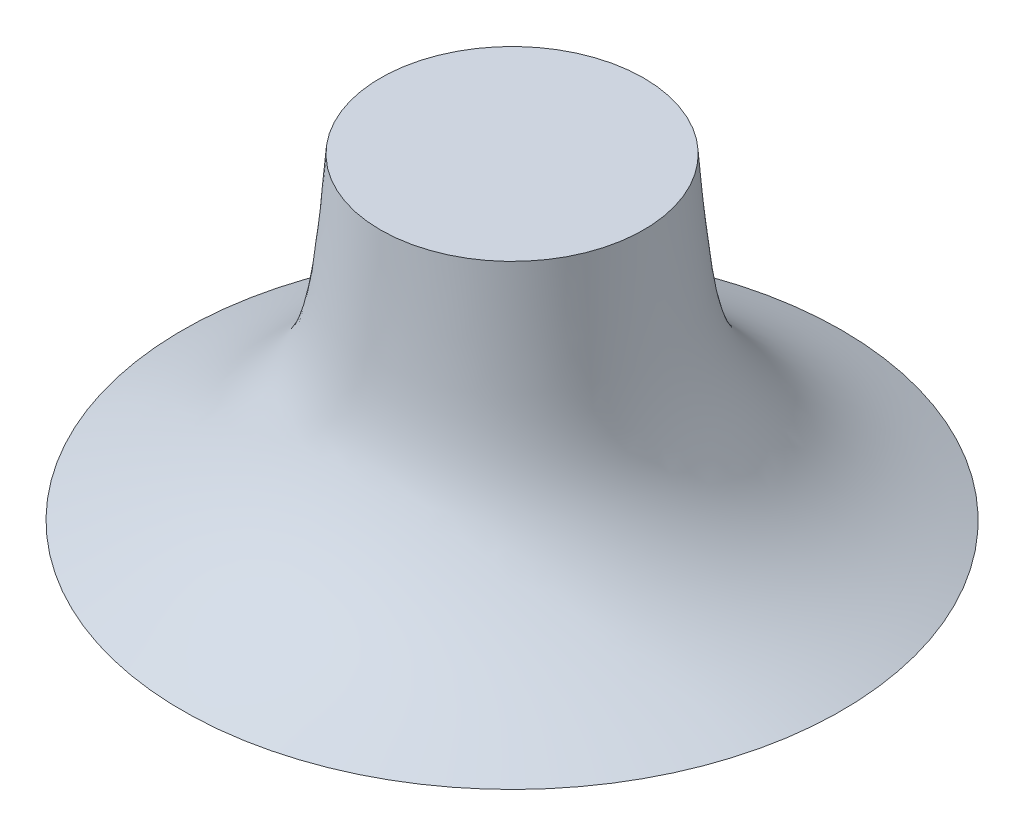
from build123d import *


with BuildPart() as part:
    # Sketch2 → Revolve1 (revolve)
    with BuildSketch(Plane.XY):
        with BuildLine():
            Line((2.421676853, 81.778571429), (-34.209961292, 81.778571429))
            add(Edge.make_bspline(
                [(-34.209961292, 81.778571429), (-34.559165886, 77.412698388), (-35.288194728, 68.697313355), (-36.617128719, 55.560717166), (-38.169288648, 44.310820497), (-40.444670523, 35.456927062), (-42.859399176, 28.976353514), (-46.166961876, 22.828893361), (-51.53973167, 15.251421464), (-59.741914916, 6.916590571), (-70.90348096, -0.997883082), (-78.770827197, -5.226695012), (-82.782475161, -7.221428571)],
                knots=[0.162761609, 0.162761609, 0.162761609, 0.162761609, 0.25795474, 0.353147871, 0.448341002, 0.495937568, 0.543534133, 0.591130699, 0.638727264, 0.733920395, 0.829113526, 0.924306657, 0.924306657, 0.924306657, 0.924306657], degree=3))
            Line((-82.782475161, -7.221428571), (2.421676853, -7.221428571))
            Line((2.421676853, -7.221428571), (2.421676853, -10.221428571))
            Line((2.421676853, -10.221428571), (-96.237497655, -10.221428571))
            add(Edge.make_bspline(
                [(-96.237497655, -10.221428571), (-94.759744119, -9.551013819), (-83.2198535, -4.30122562), (-63.613836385, 5.553827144), (-43.366564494, 28.986259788), (-39.598708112, 54.694810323), (-37.908444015, 73.151087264), (-37.17628931, 82.306300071), (-36.98120486, 84.778571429)],
                knots=[0.066076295, 0.066076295, 0.066076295, 0.066076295, 0.101283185, 0.340833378, 0.539778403, 0.744207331, 0.890467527, 0.944397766, 0.944397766, 0.944397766, 0.944397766], degree=3))
            Line((-36.98120486, 84.778571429), (2.421676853, 84.778571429))
            Line((2.421676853, 84.778571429), (2.421676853, 81.778571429))
        make_face()
    revolve(axis=Axis((2.421676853, -10.221428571, 0), (0, 1, 0)))


solid = part.part
